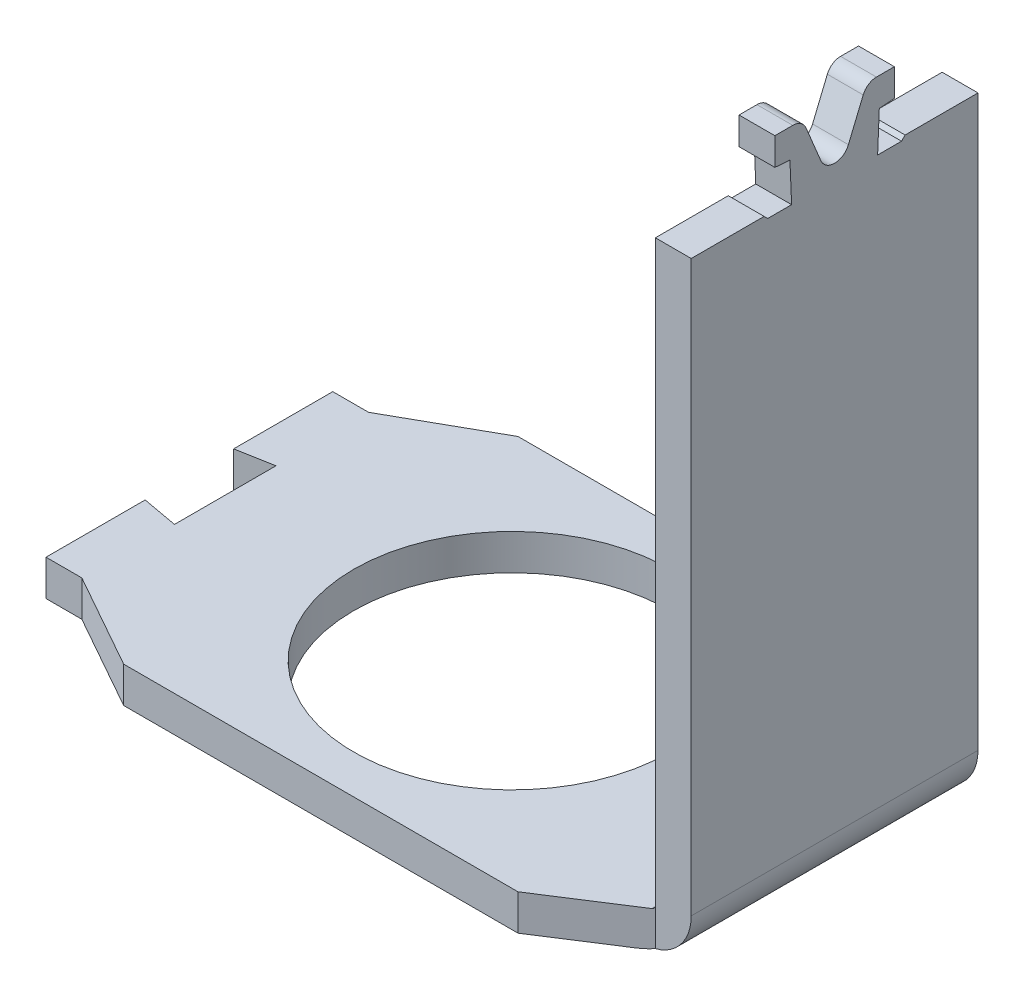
ISO-10303-21;
HEADER;
FILE_DESCRIPTION(('STEP AP214'),'2;1');
FILE_NAME('part.step','',(''),(''),'','','');
FILE_SCHEMA(('AUTOMOTIVE_DESIGN { 1 0 10303 214 1 1 1 1 }'));
ENDSEC;
DATA;
#1=APPLICATION_CONTEXT('core data for automotive mechanical design processes');
#2=APPLICATION_PROTOCOL_DEFINITION('international standard','automotive_design',2000,#1);
#3=PRODUCT_CONTEXT('',#1,'mechanical');
#4=PRODUCT('Part','Part','',(#3));
#5=PRODUCT_RELATED_PRODUCT_CATEGORY('part','',(#4));
#6=PRODUCT_DEFINITION_FORMATION('','',#4);
#7=PRODUCT_DEFINITION_CONTEXT('part definition',#1,'design');
#8=PRODUCT_DEFINITION('design','',#6,#7);
#9=PRODUCT_DEFINITION_SHAPE('','',#8);
#10=(LENGTH_UNIT() NAMED_UNIT(*) SI_UNIT(.MILLI.,.METRE.));
#11=(NAMED_UNIT(*) PLANE_ANGLE_UNIT() SI_UNIT($,.RADIAN.));
#12=(NAMED_UNIT(*) SI_UNIT($,.STERADIAN.) SOLID_ANGLE_UNIT());
#13=UNCERTAINTY_MEASURE_WITH_UNIT(LENGTH_MEASURE(1.E-05),#10,'distance_accuracy_value','');
#14=(GEOMETRIC_REPRESENTATION_CONTEXT(3) GLOBAL_UNCERTAINTY_ASSIGNED_CONTEXT((#13)) GLOBAL_UNIT_ASSIGNED_CONTEXT((#10,
#11,#12)) REPRESENTATION_CONTEXT('',''));
#15=CARTESIAN_POINT('',(0.,0.,0.));
#16=DIRECTION('',(0.,0.,1.));
#17=DIRECTION('',(1.,0.,0.));
#18=AXIS2_PLACEMENT_3D('',#15,#16,#17);
#19=CARTESIAN_POINT('',(0.,57.05,16.5));
#20=DIRECTION('',(0.,-1.,0.));
#21=DIRECTION('',(0.,0.,-1.));
#22=AXIS2_PLACEMENT_3D('',#19,#20,#21);
#23=PLANE('',#22);
#24=DIRECTION('',(-1.,0.,0.));
#25=VECTOR('',#24,1.);
#26=CARTESIAN_POINT('',(0.,57.05,3.5));
#27=LINE('',#26,#25);
#28=CARTESIAN_POINT('',(0.,57.05,3.5));
#29=VERTEX_POINT('',#28);
#30=CARTESIAN_POINT('',(-3.,57.05,3.5));
#31=VERTEX_POINT('',#30);
#32=EDGE_CURVE('E357',#29,#31,#27,.T.);
#33=ORIENTED_EDGE('',*,*,#32,.T.);
#34=DIRECTION('',(0.,0.,-1.));
#35=VECTOR('',#34,1.);
#36=CARTESIAN_POINT('',(-3.,57.05,16.5));
#37=LINE('',#36,#35);
#38=CARTESIAN_POINT('',(-3.,57.05,5.));
#39=VERTEX_POINT('',#38);
#40=EDGE_CURVE('E534',#39,#31,#37,.T.);
#41=ORIENTED_EDGE('',*,*,#40,.F.);
#42=DIRECTION('',(-1.,0.,0.));
#43=VECTOR('',#42,1.);
#44=CARTESIAN_POINT('',(0.,57.05,5.));
#45=LINE('',#44,#43);
#46=CARTESIAN_POINT('',(0.,57.05,5.));
#47=VERTEX_POINT('',#46);
#48=EDGE_CURVE('E412',#47,#39,#45,.T.);
#49=ORIENTED_EDGE('',*,*,#48,.F.);
#50=DIRECTION('',(0.,0.,-1.));
#51=VECTOR('',#50,1.);
#52=CARTESIAN_POINT('',(0.,57.05,16.5));
#53=LINE('',#52,#51);
#54=EDGE_CURVE('E538',#47,#29,#53,.T.);
#55=ORIENTED_EDGE('',*,*,#54,.T.);
#56=EDGE_LOOP('',(#33,#41,#49,#55));
#57=FACE_BOUND('',#56,.T.);
#58=ADVANCED_FACE('F32',(#57),#23,.F.);
#59=CARTESIAN_POINT('',(-54.,0.,16.5));
#60=DIRECTION('',(1.,0.,0.));
#61=DIRECTION('',(0.,0.,-1.));
#62=AXIS2_PLACEMENT_3D('',#59,#60,#61);
#63=PLANE('',#62);
#64=DIRECTION('',(0.,0.,-1.));
#65=VECTOR('',#64,1.);
#66=CARTESIAN_POINT('',(-54.,2.99999999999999,16.5));
#67=LINE('',#66,#65);
#68=CARTESIAN_POINT('',(-54.,3.,-3.7));
#69=VERTEX_POINT('',#68);
#70=CARTESIAN_POINT('',(-54.,2.99999999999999,-12.));
#71=VERTEX_POINT('',#70);
#72=EDGE_CURVE('E523',#69,#71,#67,.T.);
#73=ORIENTED_EDGE('',*,*,#72,.T.);
#74=DIRECTION('',(0.,-1.,0.));
#75=VECTOR('',#74,1.);
#76=CARTESIAN_POINT('',(-54.,0.,-12.));
#77=LINE('',#76,#75);
#78=CARTESIAN_POINT('',(-54.,0.,-12.));
#79=VERTEX_POINT('',#78);
#80=EDGE_CURVE('E572',#71,#79,#77,.T.);
#81=ORIENTED_EDGE('',*,*,#80,.T.);
#82=DIRECTION('',(0.,0.,-1.));
#83=VECTOR('',#82,1.);
#84=CARTESIAN_POINT('',(-54.,0.,16.5));
#85=LINE('',#84,#83);
#86=CARTESIAN_POINT('',(-54.,0.,-3.7));
#87=VERTEX_POINT('',#86);
#88=EDGE_CURVE('E547',#87,#79,#85,.T.);
#89=ORIENTED_EDGE('',*,*,#88,.F.);
#90=DIRECTION('',(0.,1.,0.));
#91=VECTOR('',#90,1.);
#92=CARTESIAN_POINT('',(-54.,0.,-3.7));
#93=LINE('',#92,#91);
#94=EDGE_CURVE('E569',#87,#69,#93,.T.);
#95=ORIENTED_EDGE('',*,*,#94,.T.);
#96=EDGE_LOOP('',(#73,#81,#89,#95));
#97=FACE_BOUND('',#96,.T.);
#98=ADVANCED_FACE('F669',(#97),#63,.F.);
#99=CARTESIAN_POINT('',(-4.00000000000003,0.,16.5));
#100=DIRECTION('',(0.,1.,0.));
#101=DIRECTION('',(-1.,0.,0.));
#102=AXIS2_PLACEMENT_3D('',#99,#100,#101);
#103=PLANE('',#102);
#104=DIRECTION('',(0.,0.,-1.));
#105=VECTOR('',#104,1.);
#106=CARTESIAN_POINT('',(-4.00000000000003,0.,16.5));
#107=LINE('',#106,#105);
#108=CARTESIAN_POINT('',(-4.00000000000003,0.,12.6428571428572));
#109=VERTEX_POINT('',#108);
#110=CARTESIAN_POINT('',(-4.00000000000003,0.,-12.6428571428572));
#111=VERTEX_POINT('',#110);
#112=EDGE_CURVE('E544',#109,#111,#107,.T.);
#113=ORIENTED_EDGE('',*,*,#112,.F.);
#114=DIRECTION('',(-0.841178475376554,0.,0.540757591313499));
#115=VECTOR('',#114,1.);
#116=CARTESIAN_POINT('',(-5.75451263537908,0.,13.7707581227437));
#117=LINE('',#116,#115);
#118=CARTESIAN_POINT('',(-9.99999999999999,0.,16.5));
#119=VERTEX_POINT('',#118);
#120=EDGE_CURVE('E471',#109,#119,#117,.T.);
#121=ORIENTED_EDGE('',*,*,#120,.T.);
#122=DIRECTION('',(1.,0.,0.));
#123=VECTOR('',#122,1.);
#124=CARTESIAN_POINT('',(-4.00000000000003,0.,16.5));
#125=LINE('',#124,#123);
#126=CARTESIAN_POINT('',(-43.,0.,16.5));
#127=VERTEX_POINT('',#126);
#128=EDGE_CURVE('E517',#127,#119,#125,.T.);
#129=ORIENTED_EDGE('',*,*,#128,.F.);
#130=DIRECTION('',(-0.871575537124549,0.,-0.490261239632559));
#131=VECTOR('',#130,1.);
#132=CARTESIAN_POINT('',(-13.3738872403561,0.,33.1646884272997));
#133=LINE('',#132,#131);
#134=CARTESIAN_POINT('',(-51.,0.,12.));
#135=VERTEX_POINT('',#134);
#136=EDGE_CURVE('E459',#127,#135,#133,.T.);
#137=ORIENTED_EDGE('',*,*,#136,.T.);
#138=DIRECTION('',(-1.,0.,0.));
#139=VECTOR('',#138,1.);
#140=CARTESIAN_POINT('',(-4.00000000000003,0.,12.));
#141=LINE('',#140,#139);
#142=CARTESIAN_POINT('',(-54.,0.,12.));
#143=VERTEX_POINT('',#142);
#144=EDGE_CURVE('E483',#135,#143,#141,.T.);
#145=ORIENTED_EDGE('',*,*,#144,.T.);
#146=CARTESIAN_POINT('',(-54.,0.,3.7));
#147=VERTEX_POINT('',#146);
#148=EDGE_CURVE('E550',#143,#147,#85,.T.);
#149=ORIENTED_EDGE('',*,*,#148,.T.);
#150=DIRECTION('',(0.983606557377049,0.,0.180327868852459));
#151=VECTOR('',#150,1.);
#152=CARTESIAN_POINT('',(-3.35554958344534,0.,12.9848159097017));
#153=LINE('',#152,#151);
#154=CARTESIAN_POINT('',(-51.,0.,4.25));
#155=VERTEX_POINT('',#154);
#156=EDGE_CURVE('E489',#147,#155,#153,.T.);
#157=ORIENTED_EDGE('',*,*,#156,.T.);
#158=DIRECTION('',(0.,0.,-1.));
#159=VECTOR('',#158,1.);
#160=CARTESIAN_POINT('',(-51.,0.,16.5));
#161=LINE('',#160,#159);
#162=CARTESIAN_POINT('',(-51.,0.,-4.25));
#163=VERTEX_POINT('',#162);
#164=EDGE_CURVE('E504',#155,#163,#161,.T.);
#165=ORIENTED_EDGE('',*,*,#164,.T.);
#166=DIRECTION('',(-0.983606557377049,0.,0.180327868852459));
#167=VECTOR('',#166,1.);
#168=CARTESIAN_POINT('',(-9.20881483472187,0.,-11.911717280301));
#169=LINE('',#168,#167);
#170=EDGE_CURVE('E495',#163,#87,#169,.T.);
#171=ORIENTED_EDGE('',*,*,#170,.T.);
#172=ORIENTED_EDGE('',*,*,#88,.T.);
#173=DIRECTION('',(1.,0.,0.));
#174=VECTOR('',#173,1.);
#175=CARTESIAN_POINT('',(-4.00000000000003,0.,-12.));
#176=LINE('',#175,#174);
#177=CARTESIAN_POINT('',(-51.,0.,-12.));
#178=VERTEX_POINT('',#177);
#179=EDGE_CURVE('E501',#79,#178,#176,.T.);
#180=ORIENTED_EDGE('',*,*,#179,.T.);
#181=DIRECTION('',(0.871575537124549,0.,-0.490261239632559));
#182=VECTOR('',#181,1.);
#183=CARTESIAN_POINT('',(-27.4747774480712,0.,-25.2329376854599));
#184=LINE('',#183,#182);
#185=CARTESIAN_POINT('',(-43.,0.,-16.5));
#186=VERTEX_POINT('',#185);
#187=EDGE_CURVE('E441',#178,#186,#184,.T.);
#188=ORIENTED_EDGE('',*,*,#187,.T.);
#189=DIRECTION('',(1.,0.,0.));
#190=VECTOR('',#189,1.);
#191=CARTESIAN_POINT('',(-4.00000000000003,0.,-16.5));
#192=LINE('',#191,#190);
#193=CARTESIAN_POINT('',(-10.,0.,-16.5));
#194=VERTEX_POINT('',#193);
#195=EDGE_CURVE('E511',#186,#194,#192,.T.);
#196=ORIENTED_EDGE('',*,*,#195,.T.);
#197=DIRECTION('',(0.841178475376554,0.,0.540757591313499));
#198=VECTOR('',#197,1.);
#199=CARTESIAN_POINT('',(9.25631768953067,0.,-4.12093862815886));
#200=LINE('',#199,#198);
#201=EDGE_CURVE('E453',#194,#111,#200,.T.);
#202=ORIENTED_EDGE('',*,*,#201,.T.);
#203=EDGE_LOOP('',(#113,#121,#129,#137,#145,#149,#157,#165,#171,#172,#180,#188,#196,#202));
#204=FACE_BOUND('',#203,.T.);
#205=CARTESIAN_POINT('',(-27.,0.,0.));
#206=DIRECTION('',(0.,1.,0.));
#207=DIRECTION('',(-1.,0.,0.));
#208=AXIS2_PLACEMENT_3D('',#205,#206,#207);
#209=CIRCLE('',#208,13.25);
#210=CARTESIAN_POINT('',(-40.25,0.,0.));
#211=VERTEX_POINT('',#210);
#212=EDGE_CURVE('E508',#211,#211,#209,.F.);
#213=ORIENTED_EDGE('',*,*,#212,.F.);
#214=EDGE_LOOP('',(#213));
#215=FACE_BOUND('',#214,.T.);
#216=ADVANCED_FACE('F612',(#204,#215),#103,.F.);
#217=CARTESIAN_POINT('',(-3.2,3.,16.5));
#218=DIRECTION('',(0.,-1.,0.));
#219=DIRECTION('',(1.,0.,0.));
#220=AXIS2_PLACEMENT_3D('',#217,#218,#219);
#221=PLANE('',#220);
#222=DIRECTION('',(-1.,0.,0.));
#223=VECTOR('',#222,1.);
#224=CARTESIAN_POINT('',(-3.2,3.,16.5));
#225=LINE('',#224,#223);
#226=CARTESIAN_POINT('',(-10.,3.,16.5));
#227=VERTEX_POINT('',#226);
#228=CARTESIAN_POINT('',(-43.,3.,16.5));
#229=VERTEX_POINT('',#228);
#230=EDGE_CURVE('E520',#227,#229,#225,.T.);
#231=ORIENTED_EDGE('',*,*,#230,.F.);
#232=DIRECTION('',(0.841178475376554,0.,-0.540757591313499));
#233=VECTOR('',#232,1.);
#234=CARTESIAN_POINT('',(-5.1884476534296,3.,13.4068592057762));
#235=LINE('',#234,#233);
#236=CARTESIAN_POINT('',(-3.2,3.,12.1285714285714));
#237=VERTEX_POINT('',#236);
#238=EDGE_CURVE('E465',#227,#237,#235,.T.);
#239=ORIENTED_EDGE('',*,*,#238,.T.);
#240=DIRECTION('',(0.,0.,-1.));
#241=VECTOR('',#240,1.);
#242=CARTESIAN_POINT('',(-3.2,3.,16.5));
#243=LINE('',#242,#241);
#244=CARTESIAN_POINT('',(-3.2,3.,-12.1285714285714));
#245=VERTEX_POINT('',#244);
#246=EDGE_CURVE('E527',#237,#245,#243,.T.);
#247=ORIENTED_EDGE('',*,*,#246,.T.);
#248=DIRECTION('',(-0.841178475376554,0.,-0.540757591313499));
#249=VECTOR('',#248,1.);
#250=CARTESIAN_POINT('',(9.82238267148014,3.,-3.75703971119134));
#251=LINE('',#250,#249);
#252=CARTESIAN_POINT('',(-9.99999999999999,3.,-16.5));
#253=VERTEX_POINT('',#252);
#254=EDGE_CURVE('E447',#245,#253,#251,.T.);
#255=ORIENTED_EDGE('',*,*,#254,.T.);
#256=DIRECTION('',(-1.,0.,0.));
#257=VECTOR('',#256,1.);
#258=CARTESIAN_POINT('',(-3.2,3.,-16.5));
#259=LINE('',#258,#257);
#260=CARTESIAN_POINT('',(-43.,3.,-16.5));
#261=VERTEX_POINT('',#260);
#262=EDGE_CURVE('E514',#253,#261,#259,.T.);
#263=ORIENTED_EDGE('',*,*,#262,.T.);
#264=DIRECTION('',(-0.871575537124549,0.,0.490261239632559));
#265=VECTOR('',#264,1.);
#266=CARTESIAN_POINT('',(-26.8670623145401,3.,-25.5747774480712));
#267=LINE('',#266,#265);
#268=CARTESIAN_POINT('',(-51.,3.,-12.));
#269=VERTEX_POINT('',#268);
#270=EDGE_CURVE('E438',#261,#269,#267,.T.);
#271=ORIENTED_EDGE('',*,*,#270,.T.);
#272=DIRECTION('',(-1.,0.,0.));
#273=VECTOR('',#272,1.);
#274=CARTESIAN_POINT('',(-3.2,3.,-12.));
#275=LINE('',#274,#273);
#276=EDGE_CURVE('E498',#269,#71,#275,.T.);
#277=ORIENTED_EDGE('',*,*,#276,.T.);
#278=ORIENTED_EDGE('',*,*,#72,.F.);
#279=DIRECTION('',(0.983606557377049,0.,-0.180327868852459));
#280=VECTOR('',#279,1.);
#281=CARTESIAN_POINT('',(-8.43482934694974,3.,-12.0536146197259));
#282=LINE('',#281,#280);
#283=CARTESIAN_POINT('',(-51.,3.,-4.25));
#284=VERTEX_POINT('',#283);
#285=EDGE_CURVE('E492',#69,#284,#282,.T.);
#286=ORIENTED_EDGE('',*,*,#285,.T.);
#287=DIRECTION('',(0.,0.,1.));
#288=VECTOR('',#287,1.);
#289=CARTESIAN_POINT('',(-51.,2.99999999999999,16.5));
#290=LINE('',#289,#288);
#291=CARTESIAN_POINT('',(-51.,3.,4.25));
#292=VERTEX_POINT('',#291);
#293=EDGE_CURVE('E575',#284,#292,#290,.T.);
#294=ORIENTED_EDGE('',*,*,#293,.T.);
#295=DIRECTION('',(-0.983606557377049,0.,-0.180327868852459));
#296=VECTOR('',#295,1.);
#297=CARTESIAN_POINT('',(-2.58156409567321,3.,13.1267132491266));
#298=LINE('',#297,#296);
#299=CARTESIAN_POINT('',(-54.,3.,3.7));
#300=VERTEX_POINT('',#299);
#301=EDGE_CURVE('E486',#292,#300,#298,.T.);
#302=ORIENTED_EDGE('',*,*,#301,.T.);
#303=CARTESIAN_POINT('',(-54.,2.99999999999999,12.));
#304=VERTEX_POINT('',#303);
#305=EDGE_CURVE('E526',#304,#300,#67,.T.);
#306=ORIENTED_EDGE('',*,*,#305,.F.);
#307=DIRECTION('',(1.,0.,0.));
#308=VECTOR('',#307,1.);
#309=CARTESIAN_POINT('',(-3.2,3.,12.));
#310=LINE('',#309,#308);
#311=CARTESIAN_POINT('',(-51.,3.,12.));
#312=VERTEX_POINT('',#311);
#313=EDGE_CURVE('E480',#304,#312,#310,.T.);
#314=ORIENTED_EDGE('',*,*,#313,.T.);
#315=DIRECTION('',(0.871575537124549,0.,0.490261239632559));
#316=VECTOR('',#315,1.);
#317=CARTESIAN_POINT('',(-12.7661721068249,3.,33.506528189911));
#318=LINE('',#317,#316);
#319=EDGE_CURVE('E456',#312,#229,#318,.T.);
#320=ORIENTED_EDGE('',*,*,#319,.T.);
#321=EDGE_LOOP('',(#231,#239,#247,#255,#263,#271,#277,#278,#286,#294,#302,#306,#314,#320));
#322=FACE_BOUND('',#321,.T.);
#323=CARTESIAN_POINT('',(-27.,3.,0.));
#324=DIRECTION('',(0.,-1.,0.));
#325=DIRECTION('',(1.,0.,0.));
#326=AXIS2_PLACEMENT_3D('',#323,#324,#325);
#327=CIRCLE('',#326,13.25);
#328=CARTESIAN_POINT('',(-13.75,3.,0.));
#329=VERTEX_POINT('',#328);
#330=EDGE_CURVE('E507',#329,#329,#327,.F.);
#331=ORIENTED_EDGE('',*,*,#330,.F.);
#332=EDGE_LOOP('',(#331));
#333=FACE_BOUND('',#332,.T.);
#334=ADVANCED_FACE('F604',(#322,#333),#221,.F.);
#335=ORIENTED_EDGE('',*,*,#305,.T.);
#336=DIRECTION('',(0.,-1.,0.));
#337=VECTOR('',#336,1.);
#338=CARTESIAN_POINT('',(-54.,0.,3.7));
#339=LINE('',#338,#337);
#340=EDGE_CURVE('E566',#300,#147,#339,.T.);
#341=ORIENTED_EDGE('',*,*,#340,.T.);
#342=ORIENTED_EDGE('',*,*,#148,.F.);
#343=DIRECTION('',(0.,1.,0.));
#344=VECTOR('',#343,1.);
#345=CARTESIAN_POINT('',(-54.,0.,12.));
#346=LINE('',#345,#344);
#347=EDGE_CURVE('E563',#143,#304,#346,.T.);
#348=ORIENTED_EDGE('',*,*,#347,.T.);
#349=EDGE_LOOP('',(#335,#341,#342,#348));
#350=FACE_BOUND('',#349,.T.);
#351=ADVANCED_FACE('F34',(#350),#63,.F.);
#352=CARTESIAN_POINT('',(-4.,4.,16.5));
#353=DIRECTION('',(0.,0.,-1.));
#354=DIRECTION('',(-1.,0.,0.));
#355=AXIS2_PLACEMENT_3D('',#352,#353,#354);
#356=CYLINDRICAL_SURFACE('',#355,4.);
#357=CARTESIAN_POINT('',(-4.,4.,12.));
#358=DIRECTION('',(0.,0.,-1.));
#359=DIRECTION('',(-1.,0.,0.));
#360=AXIS2_PLACEMENT_3D('',#357,#358,#359);
#361=CIRCLE('',#360,4.);
#362=CARTESIAN_POINT('',(0.,4.00000000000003,12.));
#363=VERTEX_POINT('',#362);
#364=CARTESIAN_POINT('',(-2.99999999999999,0.127016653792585,12.));
#365=VERTEX_POINT('',#364);
#366=EDGE_CURVE('E477',#363,#365,#361,.T.);
#367=ORIENTED_EDGE('',*,*,#366,.T.);
#368=CARTESIAN_POINT('',(-4.,4.,12.6428571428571));
#369=DIRECTION('',(-0.540757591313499,0.,-0.841178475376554));
#370=DIRECTION('',(0.841178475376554,0.,-0.540757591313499));
#371=AXIS2_PLACEMENT_3D('',#368,#369,#370);
#372=ELLIPSE('',#371,4.75523342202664,4.);
#373=EDGE_CURVE('E468',#365,#109,#372,.T.);
#374=ORIENTED_EDGE('',*,*,#373,.T.);
#375=ORIENTED_EDGE('',*,*,#112,.T.);
#376=CARTESIAN_POINT('',(-4.,4.,-12.6428571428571));
#377=DIRECTION('',(-0.540757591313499,0.,0.841178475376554));
#378=DIRECTION('',(-0.841178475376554,0.,-0.540757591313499));
#379=AXIS2_PLACEMENT_3D('',#376,#377,#378);
#380=ELLIPSE('',#379,4.75523342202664,4.);
#381=CARTESIAN_POINT('',(-2.99999999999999,0.127016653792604,-12.));
#382=VERTEX_POINT('',#381);
#383=EDGE_CURVE('E450',#111,#382,#380,.T.);
#384=ORIENTED_EDGE('',*,*,#383,.T.);
#385=CARTESIAN_POINT('',(-4.,4.,-12.));
#386=DIRECTION('',(0.,0.,1.));
#387=DIRECTION('',(1.,0.,0.));
#388=AXIS2_PLACEMENT_3D('',#385,#386,#387);
#389=CIRCLE('',#388,4.);
#390=CARTESIAN_POINT('',(0.,4.00000000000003,-12.));
#391=VERTEX_POINT('',#390);
#392=EDGE_CURVE('E474',#382,#391,#389,.T.);
#393=ORIENTED_EDGE('',*,*,#392,.T.);
#394=DIRECTION('',(0.,0.,-1.));
#395=VECTOR('',#394,1.);
#396=CARTESIAN_POINT('',(0.,4.00000000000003,16.5));
#397=LINE('',#396,#395);
#398=EDGE_CURVE('E541',#363,#391,#397,.T.);
#399=ORIENTED_EDGE('',*,*,#398,.F.);
#400=EDGE_LOOP('',(#367,#374,#375,#384,#393,#399));
#401=FACE_BOUND('',#400,.T.);
#402=ADVANCED_FACE('F615',(#401),#356,.T.);
#403=CARTESIAN_POINT('',(0.,4.00000000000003,16.5));
#404=DIRECTION('',(-1.,0.,0.));
#405=DIRECTION('',(0.,0.,1.));
#406=AXIS2_PLACEMENT_3D('',#403,#404,#405);
#407=PLANE('',#406);
#408=DIRECTION('',(0.,-1.,0.));
#409=VECTOR('',#408,1.);
#410=CARTESIAN_POINT('',(0.,57.05,-12.));
#411=LINE('',#410,#409);
#412=CARTESIAN_POINT('',(0.,51.65,-12.));
#413=VERTEX_POINT('',#412);
#414=EDGE_CURVE('E431',#413,#391,#411,.T.);
#415=ORIENTED_EDGE('',*,*,#414,.F.);
#416=DIRECTION('',(0.,0.,1.));
#417=VECTOR('',#416,1.);
#418=CARTESIAN_POINT('',(0.,51.65,-5.90000000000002));
#419=LINE('',#418,#417);
#420=CARTESIAN_POINT('',(0.,51.65,-5.90000000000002));
#421=VERTEX_POINT('',#420);
#422=EDGE_CURVE('E47',#413,#421,#419,.T.);
#423=ORIENTED_EDGE('',*,*,#422,.T.);
#424=DIRECTION('',(0.,-0.707106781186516,0.707106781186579));
#425=VECTOR('',#424,1.);
#426=CARTESIAN_POINT('',(0.,51.35,-5.6));
#427=LINE('',#426,#425);
#428=CARTESIAN_POINT('',(0.,51.35,-5.6));
#429=VERTEX_POINT('',#428);
#430=EDGE_CURVE('E303',#421,#429,#427,.T.);
#431=ORIENTED_EDGE('',*,*,#430,.T.);
#432=DIRECTION('',(0.,0.,1.));
#433=VECTOR('',#432,1.);
#434=CARTESIAN_POINT('',(0.,51.35,-3.6));
#435=LINE('',#434,#433);
#436=CARTESIAN_POINT('',(0.,51.35,-3.6));
#437=VERTEX_POINT('',#436);
#438=EDGE_CURVE('E306',#429,#437,#435,.T.);
#439=ORIENTED_EDGE('',*,*,#438,.T.);
#440=DIRECTION('',(0.,0.999122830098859,-0.0418756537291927));
#441=VECTOR('',#440,1.);
#442=CARTESIAN_POINT('',(0.,51.35,-3.6));
#443=LINE('',#442,#441);
#444=CARTESIAN_POINT('',(0.,54.65,-3.73831097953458));
#445=VERTEX_POINT('',#444);
#446=EDGE_CURVE('E282',#437,#445,#443,.T.);
#447=ORIENTED_EDGE('',*,*,#446,.T.);
#448=DIRECTION('',(0.,0.07901104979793,-0.996873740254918));
#449=VECTOR('',#448,1.);
#450=CARTESIAN_POINT('',(0.,54.65,-3.73831097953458));
#451=LINE('',#450,#449);
#452=CARTESIAN_POINT('',(0.,54.75,-5.));
#453=VERTEX_POINT('',#452);
#454=EDGE_CURVE('E275',#445,#453,#451,.T.);
#455=ORIENTED_EDGE('',*,*,#454,.T.);
#456=DIRECTION('',(0.,1.,0.));
#457=VECTOR('',#456,1.);
#458=CARTESIAN_POINT('',(0.,54.75,-5.));
#459=LINE('',#458,#457);
#460=CARTESIAN_POINT('',(0.,57.05,-5.));
#461=VERTEX_POINT('',#460);
#462=EDGE_CURVE('E285',#453,#461,#459,.T.);
#463=ORIENTED_EDGE('',*,*,#462,.T.);
#464=CARTESIAN_POINT('',(0.,57.05,-3.5));
#465=VERTEX_POINT('',#464);
#466=EDGE_CURVE('E537',#465,#461,#53,.T.);
#467=ORIENTED_EDGE('',*,*,#466,.F.);
#468=CARTESIAN_POINT('',(0.,55.85,-3.5));
#469=DIRECTION('',(1.,0.,0.));
#470=DIRECTION('',(0.,1.,0.));
#471=AXIS2_PLACEMENT_3D('',#468,#469,#470);
#472=CIRCLE('',#471,1.2);
#473=CARTESIAN_POINT('',(0.,56.3089036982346,-2.39121354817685));
#474=VERTEX_POINT('',#473);
#475=EDGE_CURVE('E330',#465,#474,#472,.T.);
#476=ORIENTED_EDGE('',*,*,#475,.T.);
#477=DIRECTION('',(0.,-0.923988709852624,0.38241974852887));
#478=VECTOR('',#477,1.);
#479=CARTESIAN_POINT('',(0.,53.3219753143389,-1.15498588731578));
#480=LINE('',#479,#478);
#481=CARTESIAN_POINT('',(0.,53.3219753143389,-1.15498588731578));
#482=VERTEX_POINT('',#481);
#483=EDGE_CURVE('E333',#474,#482,#480,.T.);
#484=ORIENTED_EDGE('',*,*,#483,.T.);
#485=CARTESIAN_POINT('',(0.,53.8,0.));
#486=DIRECTION('',(-1.,0.,0.));
#487=DIRECTION('',(0.,-1.,0.));
#488=AXIS2_PLACEMENT_3D('',#485,#486,#487);
#489=CIRCLE('',#488,1.25000000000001);
#490=CARTESIAN_POINT('',(0.,53.3219753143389,1.15498588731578));
#491=VERTEX_POINT('',#490);
#492=EDGE_CURVE('E337',#482,#491,#489,.T.);
#493=ORIENTED_EDGE('',*,*,#492,.T.);
#494=DIRECTION('',(0.,0.923988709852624,0.38241974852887));
#495=VECTOR('',#494,1.);
#496=CARTESIAN_POINT('',(0.,53.3219753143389,1.15498588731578));
#497=LINE('',#496,#495);
#498=CARTESIAN_POINT('',(0.,56.3089036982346,2.39121354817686));
#499=VERTEX_POINT('',#498);
#500=EDGE_CURVE('E340',#491,#499,#497,.T.);
#501=ORIENTED_EDGE('',*,*,#500,.T.);
#502=CARTESIAN_POINT('',(0.,55.85,3.5));
#503=DIRECTION('',(1.,0.,0.));
#504=DIRECTION('',(0.,-1.,0.));
#505=AXIS2_PLACEMENT_3D('',#502,#503,#504);
#506=CIRCLE('',#505,1.2);
#507=EDGE_CURVE('E343',#499,#29,#506,.T.);
#508=ORIENTED_EDGE('',*,*,#507,.T.);
#509=ORIENTED_EDGE('',*,*,#54,.F.);
#510=DIRECTION('',(0.,-1.,0.));
#511=VECTOR('',#510,1.);
#512=CARTESIAN_POINT('',(0.,54.75,5.));
#513=LINE('',#512,#511);
#514=CARTESIAN_POINT('',(0.,54.75,5.));
#515=VERTEX_POINT('',#514);
#516=EDGE_CURVE('E380',#47,#515,#513,.T.);
#517=ORIENTED_EDGE('',*,*,#516,.T.);
#518=DIRECTION('',(0.,-0.07901104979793,-0.996873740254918));
#519=VECTOR('',#518,1.);
#520=CARTESIAN_POINT('',(0.,54.65,3.73831097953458));
#521=LINE('',#520,#519);
#522=CARTESIAN_POINT('',(0.,54.65,3.73831097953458));
#523=VERTEX_POINT('',#522);
#524=EDGE_CURVE('E383',#515,#523,#521,.T.);
#525=ORIENTED_EDGE('',*,*,#524,.T.);
#526=DIRECTION('',(0.,-0.999122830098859,-0.0418756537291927));
#527=VECTOR('',#526,1.);
#528=CARTESIAN_POINT('',(0.,51.35,3.6));
#529=LINE('',#528,#527);
#530=CARTESIAN_POINT('',(0.,51.35,3.6));
#531=VERTEX_POINT('',#530);
#532=EDGE_CURVE('E386',#523,#531,#529,.T.);
#533=ORIENTED_EDGE('',*,*,#532,.T.);
#534=DIRECTION('',(0.,0.,1.));
#535=VECTOR('',#534,1.);
#536=CARTESIAN_POINT('',(0.,51.35,3.6));
#537=LINE('',#536,#535);
#538=CARTESIAN_POINT('',(0.,51.35,5.6));
#539=VERTEX_POINT('',#538);
#540=EDGE_CURVE('E370',#531,#539,#537,.T.);
#541=ORIENTED_EDGE('',*,*,#540,.T.);
#542=DIRECTION('',(0.,0.707106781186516,0.707106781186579));
#543=VECTOR('',#542,1.);
#544=CARTESIAN_POINT('',(0.,51.35,5.6));
#545=LINE('',#544,#543);
#546=CARTESIAN_POINT('',(0.,51.65,5.90000000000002));
#547=VERTEX_POINT('',#546);
#548=EDGE_CURVE('E373',#539,#547,#545,.T.);
#549=ORIENTED_EDGE('',*,*,#548,.T.);
#550=DIRECTION('',(0.,0.,1.));
#551=VECTOR('',#550,1.);
#552=CARTESIAN_POINT('',(0.,51.65,5.90000000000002));
#553=LINE('',#552,#551);
#554=CARTESIAN_POINT('',(0.,51.65,12.));
#555=VERTEX_POINT('',#554);
#556=EDGE_CURVE('E377',#547,#555,#553,.T.);
#557=ORIENTED_EDGE('',*,*,#556,.T.);
#558=DIRECTION('',(0.,-1.,0.));
#559=VECTOR('',#558,1.);
#560=CARTESIAN_POINT('',(0.,57.05,12.));
#561=LINE('',#560,#559);
#562=EDGE_CURVE('E433',#555,#363,#561,.T.);
#563=ORIENTED_EDGE('',*,*,#562,.T.);
#564=ORIENTED_EDGE('',*,*,#398,.T.);
#565=EDGE_LOOP('',(#415,#423,#431,#439,#447,#455,#463,#467,#476,#484,#493,#501,#508,#509,#517,
#525,#533,#541,#549,#557,#563,#564));
#566=FACE_BOUND('',#565,.T.);
#567=ADVANCED_FACE('F293',(#566),#407,.F.);
#568=ORIENTED_EDGE('',*,*,#466,.T.);
#569=DIRECTION('',(-1.,0.,0.));
#570=VECTOR('',#569,1.);
#571=CARTESIAN_POINT('',(0.,57.05,-5.));
#572=LINE('',#571,#570);
#573=CARTESIAN_POINT('',(-3.,57.05,-5.));
#574=VERTEX_POINT('',#573);
#575=EDGE_CURVE('E281',#461,#574,#572,.T.);
#576=ORIENTED_EDGE('',*,*,#575,.T.);
#577=CARTESIAN_POINT('',(-3.,57.05,-3.5));
#578=VERTEX_POINT('',#577);
#579=EDGE_CURVE('E533',#578,#574,#37,.T.);
#580=ORIENTED_EDGE('',*,*,#579,.F.);
#581=DIRECTION('',(-1.,0.,0.));
#582=VECTOR('',#581,1.);
#583=CARTESIAN_POINT('',(0.,57.05,-3.5));
#584=LINE('',#583,#582);
#585=EDGE_CURVE('E54',#465,#578,#584,.T.);
#586=ORIENTED_EDGE('',*,*,#585,.F.);
#587=EDGE_LOOP('',(#568,#576,#580,#586));
#588=FACE_BOUND('',#587,.T.);
#589=ADVANCED_FACE('F659',(#588),#23,.F.);
#590=CARTESIAN_POINT('',(-3.,3.2,16.5));
#591=DIRECTION('',(1.,0.,0.));
#592=DIRECTION('',(0.,1.,0.));
#593=AXIS2_PLACEMENT_3D('',#590,#591,#592);
#594=PLANE('',#593);
#595=DIRECTION('',(0.,-0.707106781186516,0.707106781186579));
#596=VECTOR('',#595,1.);
#597=CARTESIAN_POINT('',(-3.,51.35,-5.6));
#598=LINE('',#597,#596);
#599=CARTESIAN_POINT('',(-3.,51.65,-5.90000000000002));
#600=VERTEX_POINT('',#599);
#601=CARTESIAN_POINT('',(-3.,51.35,-5.6));
#602=VERTEX_POINT('',#601);
#603=EDGE_CURVE('E314',#600,#602,#598,.T.);
#604=ORIENTED_EDGE('',*,*,#603,.F.);
#605=DIRECTION('',(0.,0.,1.));
#606=VECTOR('',#605,1.);
#607=CARTESIAN_POINT('',(-3.,51.65,-5.90000000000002));
#608=LINE('',#607,#606);
#609=CARTESIAN_POINT('',(-3.,51.65,-12.));
#610=VERTEX_POINT('',#609);
#611=EDGE_CURVE('E312',#610,#600,#608,.T.);
#612=ORIENTED_EDGE('',*,*,#611,.F.);
#613=DIRECTION('',(0.,-1.,0.));
#614=VECTOR('',#613,1.);
#615=CARTESIAN_POINT('',(-3.,57.05,-12.));
#616=LINE('',#615,#614);
#617=CARTESIAN_POINT('',(-3.,3.2,-12.));
#618=VERTEX_POINT('',#617);
#619=EDGE_CURVE('E429',#610,#618,#616,.T.);
#620=ORIENTED_EDGE('',*,*,#619,.T.);
#621=DIRECTION('',(0.,0.,-1.));
#622=VECTOR('',#621,1.);
#623=CARTESIAN_POINT('',(-3.,3.2,16.5));
#624=LINE('',#623,#622);
#625=CARTESIAN_POINT('',(-2.99999999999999,3.2,12.));
#626=VERTEX_POINT('',#625);
#627=EDGE_CURVE('E530',#626,#618,#624,.T.);
#628=ORIENTED_EDGE('',*,*,#627,.F.);
#629=DIRECTION('',(0.,-1.,0.));
#630=VECTOR('',#629,1.);
#631=CARTESIAN_POINT('',(-3.,57.05,12.));
#632=LINE('',#631,#630);
#633=CARTESIAN_POINT('',(-3.,51.65,12.));
#634=VERTEX_POINT('',#633);
#635=EDGE_CURVE('E436',#634,#626,#632,.T.);
#636=ORIENTED_EDGE('',*,*,#635,.F.);
#637=DIRECTION('',(0.,0.,1.));
#638=VECTOR('',#637,1.);
#639=CARTESIAN_POINT('',(-3.,51.65,5.90000000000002));
#640=LINE('',#639,#638);
#641=CARTESIAN_POINT('',(-3.,51.65,5.90000000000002));
#642=VERTEX_POINT('',#641);
#643=EDGE_CURVE('E395',#642,#634,#640,.T.);
#644=ORIENTED_EDGE('',*,*,#643,.F.);
#645=DIRECTION('',(0.,0.707106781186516,0.707106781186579));
#646=VECTOR('',#645,1.);
#647=CARTESIAN_POINT('',(-3.,51.35,5.6));
#648=LINE('',#647,#646);
#649=CARTESIAN_POINT('',(-3.,51.35,5.6));
#650=VERTEX_POINT('',#649);
#651=EDGE_CURVE('E392',#650,#642,#648,.T.);
#652=ORIENTED_EDGE('',*,*,#651,.F.);
#653=DIRECTION('',(0.,0.,1.));
#654=VECTOR('',#653,1.);
#655=CARTESIAN_POINT('',(-3.,51.35,3.6));
#656=LINE('',#655,#654);
#657=CARTESIAN_POINT('',(-3.,51.35,3.6));
#658=VERTEX_POINT('',#657);
#659=EDGE_CURVE('E360',#658,#650,#656,.T.);
#660=ORIENTED_EDGE('',*,*,#659,.F.);
#661=DIRECTION('',(0.,-0.999122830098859,-0.0418756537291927));
#662=VECTOR('',#661,1.);
#663=CARTESIAN_POINT('',(-3.,51.35,3.6));
#664=LINE('',#663,#662);
#665=CARTESIAN_POINT('',(-3.,54.65,3.73831097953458));
#666=VERTEX_POINT('',#665);
#667=EDGE_CURVE('E374',#666,#658,#664,.T.);
#668=ORIENTED_EDGE('',*,*,#667,.F.);
#669=DIRECTION('',(0.,-0.07901104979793,-0.996873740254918));
#670=VECTOR('',#669,1.);
#671=CARTESIAN_POINT('',(-3.,54.65,3.73831097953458));
#672=LINE('',#671,#670);
#673=CARTESIAN_POINT('',(-3.,54.75,5.));
#674=VERTEX_POINT('',#673);
#675=EDGE_CURVE('E400',#674,#666,#672,.T.);
#676=ORIENTED_EDGE('',*,*,#675,.F.);
#677=DIRECTION('',(0.,-1.,0.));
#678=VECTOR('',#677,1.);
#679=CARTESIAN_POINT('',(-3.,54.75,5.));
#680=LINE('',#679,#678);
#681=EDGE_CURVE('E397',#39,#674,#680,.T.);
#682=ORIENTED_EDGE('',*,*,#681,.F.);
#683=ORIENTED_EDGE('',*,*,#40,.T.);
#684=CARTESIAN_POINT('',(-3.,55.85,3.5));
#685=DIRECTION('',(1.,0.,0.));
#686=DIRECTION('',(0.,-1.,0.));
#687=AXIS2_PLACEMENT_3D('',#684,#685,#686);
#688=CIRCLE('',#687,1.2);
#689=CARTESIAN_POINT('',(-3.,56.3089036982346,2.39121354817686));
#690=VERTEX_POINT('',#689);
#691=EDGE_CURVE('E334',#690,#31,#688,.T.);
#692=ORIENTED_EDGE('',*,*,#691,.F.);
#693=DIRECTION('',(0.,0.923988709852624,0.38241974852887));
#694=VECTOR('',#693,1.);
#695=CARTESIAN_POINT('',(-3.,53.3219753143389,1.15498588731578));
#696=LINE('',#695,#694);
#697=CARTESIAN_POINT('',(-3.,53.3219753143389,1.15498588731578));
#698=VERTEX_POINT('',#697);
#699=EDGE_CURVE('E353',#698,#690,#696,.T.);
#700=ORIENTED_EDGE('',*,*,#699,.F.);
#701=CARTESIAN_POINT('',(-3.,53.8,0.));
#702=DIRECTION('',(-1.,0.,0.));
#703=DIRECTION('',(0.,-1.,0.));
#704=AXIS2_PLACEMENT_3D('',#701,#702,#703);
#705=CIRCLE('',#704,1.25000000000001);
#706=CARTESIAN_POINT('',(-3.,53.3219753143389,-1.15498588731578));
#707=VERTEX_POINT('',#706);
#708=EDGE_CURVE('E350',#707,#698,#705,.T.);
#709=ORIENTED_EDGE('',*,*,#708,.F.);
#710=DIRECTION('',(0.,-0.923988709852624,0.38241974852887));
#711=VECTOR('',#710,1.);
#712=CARTESIAN_POINT('',(-3.,53.3219753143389,-1.15498588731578));
#713=LINE('',#712,#711);
#714=CARTESIAN_POINT('',(-3.,56.3089036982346,-2.39121354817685));
#715=VERTEX_POINT('',#714);
#716=EDGE_CURVE('E347',#715,#707,#713,.T.);
#717=ORIENTED_EDGE('',*,*,#716,.F.);
#718=CARTESIAN_POINT('',(-3.,55.85,-3.5));
#719=DIRECTION('',(1.,0.,0.));
#720=DIRECTION('',(0.,1.,0.));
#721=AXIS2_PLACEMENT_3D('',#718,#719,#720);
#722=CIRCLE('',#721,1.2);
#723=EDGE_CURVE('E321',#578,#715,#722,.T.);
#724=ORIENTED_EDGE('',*,*,#723,.F.);
#725=ORIENTED_EDGE('',*,*,#579,.T.);
#726=DIRECTION('',(0.,1.,0.));
#727=VECTOR('',#726,1.);
#728=CARTESIAN_POINT('',(-3.,54.75,-5.));
#729=LINE('',#728,#727);
#730=CARTESIAN_POINT('',(-3.,54.75,-5.));
#731=VERTEX_POINT('',#730);
#732=EDGE_CURVE('E310',#731,#574,#729,.T.);
#733=ORIENTED_EDGE('',*,*,#732,.F.);
#734=DIRECTION('',(0.,0.07901104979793,-0.996873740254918));
#735=VECTOR('',#734,1.);
#736=CARTESIAN_POINT('',(-3.,54.65,-3.73831097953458));
#737=LINE('',#736,#735);
#738=CARTESIAN_POINT('',(-3.,54.65,-3.73831097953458));
#739=VERTEX_POINT('',#738);
#740=EDGE_CURVE('E278',#739,#731,#737,.T.);
#741=ORIENTED_EDGE('',*,*,#740,.F.);
#742=DIRECTION('',(0.,0.999122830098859,-0.0418756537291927));
#743=VECTOR('',#742,1.);
#744=CARTESIAN_POINT('',(-3.,51.35,-3.6));
#745=LINE('',#744,#743);
#746=CARTESIAN_POINT('',(-3.,51.35,-3.6));
#747=VERTEX_POINT('',#746);
#748=EDGE_CURVE('E296',#747,#739,#745,.T.);
#749=ORIENTED_EDGE('',*,*,#748,.F.);
#750=DIRECTION('',(0.,0.,1.));
#751=VECTOR('',#750,1.);
#752=CARTESIAN_POINT('',(-3.,51.35,-3.6));
#753=LINE('',#752,#751);
#754=EDGE_CURVE('E299',#602,#747,#753,.T.);
#755=ORIENTED_EDGE('',*,*,#754,.F.);
#756=EDGE_LOOP('',(#604,#612,#620,#628,#636,#644,#652,#660,#668,#676,#682,#683,#692,#700,#709,
#717,#724,#725,#733,#741,#749,#755));
#757=FACE_BOUND('',#756,.T.);
#758=ADVANCED_FACE('F591',(#757),#594,.F.);
#759=CARTESIAN_POINT('',(-3.2,3.2,16.5));
#760=DIRECTION('',(0.,0.,-1.));
#761=DIRECTION('',(-1.,0.,0.));
#762=AXIS2_PLACEMENT_3D('',#759,#760,#761);
#763=CYLINDRICAL_SURFACE('',#762,0.2);
#764=ORIENTED_EDGE('',*,*,#246,.F.);
#765=CARTESIAN_POINT('',(-3.2,3.2,12.1285714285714));
#766=DIRECTION('',(-0.540757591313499,0.,-0.841178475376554));
#767=DIRECTION('',(0.841178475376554,0.,-0.540757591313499));
#768=AXIS2_PLACEMENT_3D('',#765,#766,#767);
#769=ELLIPSE('',#768,0.237761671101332,0.2);
#770=EDGE_CURVE('E462',#237,#626,#769,.F.);
#771=ORIENTED_EDGE('',*,*,#770,.T.);
#772=ORIENTED_EDGE('',*,*,#627,.T.);
#773=CARTESIAN_POINT('',(-3.2,3.2,-12.1285714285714));
#774=DIRECTION('',(-0.540757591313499,0.,0.841178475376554));
#775=DIRECTION('',(-0.841178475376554,0.,-0.540757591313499));
#776=AXIS2_PLACEMENT_3D('',#773,#774,#775);
#777=ELLIPSE('',#776,0.237761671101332,0.2);
#778=EDGE_CURVE('E444',#618,#245,#777,.F.);
#779=ORIENTED_EDGE('',*,*,#778,.T.);
#780=EDGE_LOOP('',(#764,#771,#772,#779));
#781=FACE_BOUND('',#780,.T.);
#782=ADVANCED_FACE('F598',(#781),#763,.F.);
#783=CARTESIAN_POINT('',(-3.2,3.2,16.5));
#784=DIRECTION('',(0.,0.,1.));
#785=DIRECTION('',(1.,0.,0.));
#786=AXIS2_PLACEMENT_3D('',#783,#784,#785);
#787=PLANE('',#786);
#788=DIRECTION('',(0.,-1.,0.));
#789=VECTOR('',#788,1.);
#790=CARTESIAN_POINT('',(-10.,3.2,16.5));
#791=LINE('',#790,#789);
#792=EDGE_CURVE('E561',#227,#119,#791,.T.);
#793=ORIENTED_EDGE('',*,*,#792,.F.);
#794=ORIENTED_EDGE('',*,*,#230,.T.);
#795=DIRECTION('',(0.,1.,0.));
#796=VECTOR('',#795,1.);
#797=CARTESIAN_POINT('',(-43.,3.2,16.5));
#798=LINE('',#797,#796);
#799=EDGE_CURVE('E559',#127,#229,#798,.T.);
#800=ORIENTED_EDGE('',*,*,#799,.F.);
#801=ORIENTED_EDGE('',*,*,#128,.T.);
#802=EDGE_LOOP('',(#793,#794,#800,#801));
#803=FACE_BOUND('',#802,.T.);
#804=ADVANCED_FACE('F608',(#803),#787,.T.);
#805=CARTESIAN_POINT('',(-3.2,3.2,-16.5));
#806=DIRECTION('',(0.,0.,1.));
#807=DIRECTION('',(1.,0.,0.));
#808=AXIS2_PLACEMENT_3D('',#805,#806,#807);
#809=PLANE('',#808);
#810=ORIENTED_EDGE('',*,*,#262,.F.);
#811=DIRECTION('',(0.,-1.,0.));
#812=VECTOR('',#811,1.);
#813=CARTESIAN_POINT('',(-10.,3.2,-16.5));
#814=LINE('',#813,#812);
#815=EDGE_CURVE('E556',#253,#194,#814,.T.);
#816=ORIENTED_EDGE('',*,*,#815,.T.);
#817=ORIENTED_EDGE('',*,*,#195,.F.);
#818=DIRECTION('',(0.,1.,0.));
#819=VECTOR('',#818,1.);
#820=CARTESIAN_POINT('',(-43.,3.2,-16.5));
#821=LINE('',#820,#819);
#822=EDGE_CURVE('E553',#186,#261,#821,.T.);
#823=ORIENTED_EDGE('',*,*,#822,.T.);
#824=EDGE_LOOP('',(#810,#816,#817,#823));
#825=FACE_BOUND('',#824,.T.);
#826=ADVANCED_FACE('F741',(#825),#809,.F.);
#827=CARTESIAN_POINT('',(-27.,57.05,0.));
#828=DIRECTION('',(0.,-1.,0.));
#829=DIRECTION('',(1.,0.,0.));
#830=AXIS2_PLACEMENT_3D('',#827,#828,#829);
#831=CYLINDRICAL_SURFACE('',#830,13.25);
#832=ORIENTED_EDGE('',*,*,#330,.T.);
#833=EDGE_LOOP('',(#832));
#834=FACE_BOUND('',#833,.T.);
#835=ORIENTED_EDGE('',*,*,#212,.T.);
#836=EDGE_LOOP('',(#835));
#837=FACE_BOUND('',#836,.T.);
#838=ADVANCED_FACE('F730',(#834,#837),#831,.F.);
#839=CARTESIAN_POINT('',(-43.,57.05,-16.5));
#840=DIRECTION('',(0.490261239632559,0.,0.871575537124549));
#841=DIRECTION('',(0.871575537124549,0.,-0.490261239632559));
#842=AXIS2_PLACEMENT_3D('',#839,#840,#841);
#843=PLANE('',#842);
#844=DIRECTION('',(0.,-1.,0.));
#845=VECTOR('',#844,1.);
#846=CARTESIAN_POINT('',(-51.,57.05,-12.));
#847=LINE('',#846,#845);
#848=EDGE_CURVE('E425',#269,#178,#847,.T.);
#849=ORIENTED_EDGE('',*,*,#848,.F.);
#850=ORIENTED_EDGE('',*,*,#270,.F.);
#851=ORIENTED_EDGE('',*,*,#822,.F.);
#852=ORIENTED_EDGE('',*,*,#187,.F.);
#853=EDGE_LOOP('',(#849,#850,#851,#852));
#854=FACE_BOUND('',#853,.T.);
#855=ADVANCED_FACE('F726',(#854),#843,.F.);
#856=CARTESIAN_POINT('',(-51.,57.05,-12.));
#857=DIRECTION('',(0.,0.,1.));
#858=DIRECTION('',(1.,0.,0.));
#859=AXIS2_PLACEMENT_3D('',#856,#857,#858);
#860=PLANE('',#859);
#861=ORIENTED_EDGE('',*,*,#80,.F.);
#862=ORIENTED_EDGE('',*,*,#276,.F.);
#863=ORIENTED_EDGE('',*,*,#848,.T.);
#864=ORIENTED_EDGE('',*,*,#179,.F.);
#865=EDGE_LOOP('',(#861,#862,#863,#864));
#866=FACE_BOUND('',#865,.T.);
#867=ADVANCED_FACE('F723',(#866),#860,.F.);
#868=CARTESIAN_POINT('',(-3.,57.05,-12.));
#869=DIRECTION('',(-0.540757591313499,0.,0.841178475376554));
#870=DIRECTION('',(0.841178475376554,0.,0.540757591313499));
#871=AXIS2_PLACEMENT_3D('',#868,#869,#870);
#872=PLANE('',#871);
#873=ORIENTED_EDGE('',*,*,#815,.F.);
#874=ORIENTED_EDGE('',*,*,#254,.F.);
#875=ORIENTED_EDGE('',*,*,#778,.F.);
#876=EDGE_CURVE('E428',#618,#382,#616,.T.);
#877=ORIENTED_EDGE('',*,*,#876,.T.);
#878=ORIENTED_EDGE('',*,*,#383,.F.);
#879=ORIENTED_EDGE('',*,*,#201,.F.);
#880=EDGE_LOOP('',(#873,#874,#875,#877,#878,#879));
#881=FACE_BOUND('',#880,.T.);
#882=ADVANCED_FACE('F709',(#881),#872,.F.);
#883=CARTESIAN_POINT('',(0.,57.05,-12.));
#884=DIRECTION('',(0.,0.,1.));
#885=DIRECTION('',(1.,0.,0.));
#886=AXIS2_PLACEMENT_3D('',#883,#884,#885);
#887=PLANE('',#886);
#888=ORIENTED_EDGE('',*,*,#619,.F.);
#889=DIRECTION('',(1.,0.,0.));
#890=VECTOR('',#889,1.);
#891=CARTESIAN_POINT('',(0.,51.65,-12.));
#892=LINE('',#891,#890);
#893=EDGE_CURVE('E12',#610,#413,#892,.T.);
#894=ORIENTED_EDGE('',*,*,#893,.T.);
#895=ORIENTED_EDGE('',*,*,#414,.T.);
#896=ORIENTED_EDGE('',*,*,#392,.F.);
#897=ORIENTED_EDGE('',*,*,#876,.F.);
#898=EDGE_LOOP('',(#888,#894,#895,#896,#897));
#899=FACE_BOUND('',#898,.T.);
#900=ADVANCED_FACE('F702',(#899),#887,.F.);
#901=CARTESIAN_POINT('',(-43.,57.05,16.5));
#902=DIRECTION('',(0.490261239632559,0.,-0.871575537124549));
#903=DIRECTION('',(-0.871575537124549,0.,-0.490261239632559));
#904=AXIS2_PLACEMENT_3D('',#901,#902,#903);
#905=PLANE('',#904);
#906=ORIENTED_EDGE('',*,*,#799,.T.);
#907=ORIENTED_EDGE('',*,*,#319,.F.);
#908=DIRECTION('',(0.,-1.,0.));
#909=VECTOR('',#908,1.);
#910=CARTESIAN_POINT('',(-51.,57.05,12.));
#911=LINE('',#910,#909);
#912=EDGE_CURVE('E407',#312,#135,#911,.T.);
#913=ORIENTED_EDGE('',*,*,#912,.T.);
#914=ORIENTED_EDGE('',*,*,#136,.F.);
#915=EDGE_LOOP('',(#906,#907,#913,#914));
#916=FACE_BOUND('',#915,.T.);
#917=ADVANCED_FACE('F700',(#916),#905,.F.);
#918=CARTESIAN_POINT('',(-51.,57.05,12.));
#919=DIRECTION('',(0.,0.,-1.));
#920=DIRECTION('',(-1.,0.,0.));
#921=AXIS2_PLACEMENT_3D('',#918,#919,#920);
#922=PLANE('',#921);
#923=ORIENTED_EDGE('',*,*,#912,.F.);
#924=ORIENTED_EDGE('',*,*,#313,.F.);
#925=ORIENTED_EDGE('',*,*,#347,.F.);
#926=ORIENTED_EDGE('',*,*,#144,.F.);
#927=EDGE_LOOP('',(#923,#924,#925,#926));
#928=FACE_BOUND('',#927,.T.);
#929=ADVANCED_FACE('F698',(#928),#922,.F.);
#930=CARTESIAN_POINT('',(-3.,57.05,12.));
#931=DIRECTION('',(-0.540757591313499,0.,-0.841178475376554));
#932=DIRECTION('',(-0.841178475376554,0.,0.540757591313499));
#933=AXIS2_PLACEMENT_3D('',#930,#931,#932);
#934=PLANE('',#933);
#935=ORIENTED_EDGE('',*,*,#373,.F.);
#936=EDGE_CURVE('E435',#626,#365,#632,.T.);
#937=ORIENTED_EDGE('',*,*,#936,.F.);
#938=ORIENTED_EDGE('',*,*,#770,.F.);
#939=ORIENTED_EDGE('',*,*,#238,.F.);
#940=ORIENTED_EDGE('',*,*,#792,.T.);
#941=ORIENTED_EDGE('',*,*,#120,.F.);
#942=EDGE_LOOP('',(#935,#937,#938,#939,#940,#941));
#943=FACE_BOUND('',#942,.T.);
#944=ADVANCED_FACE('F600',(#943),#934,.F.);
#945=CARTESIAN_POINT('',(0.,57.05,12.));
#946=DIRECTION('',(0.,0.,-1.));
#947=DIRECTION('',(-1.,0.,0.));
#948=AXIS2_PLACEMENT_3D('',#945,#946,#947);
#949=PLANE('',#948);
#950=ORIENTED_EDGE('',*,*,#562,.F.);
#951=DIRECTION('',(-1.,0.,0.));
#952=VECTOR('',#951,1.);
#953=CARTESIAN_POINT('',(0.,51.65,12.));
#954=LINE('',#953,#952);
#955=EDGE_CURVE('E40',#555,#634,#954,.T.);
#956=ORIENTED_EDGE('',*,*,#955,.T.);
#957=ORIENTED_EDGE('',*,*,#635,.T.);
#958=ORIENTED_EDGE('',*,*,#936,.T.);
#959=ORIENTED_EDGE('',*,*,#366,.F.);
#960=EDGE_LOOP('',(#950,#956,#957,#958,#959));
#961=FACE_BOUND('',#960,.T.);
#962=ADVANCED_FACE('F581',(#961),#949,.F.);
#963=CARTESIAN_POINT('',(-51.,57.05,-4.25));
#964=DIRECTION('',(1.,0.,0.));
#965=DIRECTION('',(0.,1.,0.));
#966=AXIS2_PLACEMENT_3D('',#963,#964,#965);
#967=PLANE('',#966);
#968=DIRECTION('',(0.,-1.,0.));
#969=VECTOR('',#968,1.);
#970=CARTESIAN_POINT('',(-51.,57.05,4.25));
#971=LINE('',#970,#969);
#972=EDGE_CURVE('E419',#292,#155,#971,.T.);
#973=ORIENTED_EDGE('',*,*,#972,.F.);
#974=ORIENTED_EDGE('',*,*,#293,.F.);
#975=DIRECTION('',(0.,-1.,0.));
#976=VECTOR('',#975,1.);
#977=CARTESIAN_POINT('',(-51.,57.05,-4.25));
#978=LINE('',#977,#976);
#979=EDGE_CURVE('E422',#284,#163,#978,.T.);
#980=ORIENTED_EDGE('',*,*,#979,.T.);
#981=ORIENTED_EDGE('',*,*,#164,.F.);
#982=EDGE_LOOP('',(#973,#974,#980,#981));
#983=FACE_BOUND('',#982,.T.);
#984=ADVANCED_FACE('F693',(#983),#967,.F.);
#985=CARTESIAN_POINT('',(-51.,57.05,-4.25));
#986=DIRECTION('',(-0.180327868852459,0.,-0.983606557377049));
#987=DIRECTION('',(-0.983606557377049,0.,0.180327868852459));
#988=AXIS2_PLACEMENT_3D('',#985,#986,#987);
#989=PLANE('',#988);
#990=ORIENTED_EDGE('',*,*,#979,.F.);
#991=ORIENTED_EDGE('',*,*,#285,.F.);
#992=ORIENTED_EDGE('',*,*,#94,.F.);
#993=ORIENTED_EDGE('',*,*,#170,.F.);
#994=EDGE_LOOP('',(#990,#991,#992,#993));
#995=FACE_BOUND('',#994,.T.);
#996=ADVANCED_FACE('F717',(#995),#989,.F.);
#997=CARTESIAN_POINT('',(-51.,57.05,4.25));
#998=DIRECTION('',(-0.180327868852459,0.,0.983606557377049));
#999=DIRECTION('',(0.983606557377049,0.,0.180327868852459));
#1000=AXIS2_PLACEMENT_3D('',#997,#998,#999);
#1001=PLANE('',#1000);
#1002=ORIENTED_EDGE('',*,*,#340,.F.);
#1003=ORIENTED_EDGE('',*,*,#301,.F.);
#1004=ORIENTED_EDGE('',*,*,#972,.T.);
#1005=ORIENTED_EDGE('',*,*,#156,.F.);
#1006=EDGE_LOOP('',(#1002,#1003,#1004,#1005));
#1007=FACE_BOUND('',#1006,.T.);
#1008=ADVANCED_FACE('F691',(#1007),#1001,.F.);
#1009=CARTESIAN_POINT('',(0.,51.65,5.90000000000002));
#1010=DIRECTION('',(0.,-1.,0.));
#1011=DIRECTION('',(0.,0.,-1.));
#1012=AXIS2_PLACEMENT_3D('',#1009,#1010,#1011);
#1013=PLANE('',#1012);
#1014=ORIENTED_EDGE('',*,*,#556,.F.);
#1015=DIRECTION('',(-1.,0.,0.));
#1016=VECTOR('',#1015,1.);
#1017=CARTESIAN_POINT('',(0.,51.65,5.90000000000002));
#1018=LINE('',#1017,#1016);
#1019=EDGE_CURVE('E414',#547,#642,#1018,.T.);
#1020=ORIENTED_EDGE('',*,*,#1019,.T.);
#1021=ORIENTED_EDGE('',*,*,#643,.T.);
#1022=ORIENTED_EDGE('',*,*,#955,.F.);
#1023=EDGE_LOOP('',(#1014,#1020,#1021,#1022));
#1024=FACE_BOUND('',#1023,.T.);
#1025=ADVANCED_FACE('F618',(#1024),#1013,.F.);
#1026=CARTESIAN_POINT('',(0.,51.35,3.6));
#1027=DIRECTION('',(0.,-1.,0.));
#1028=DIRECTION('',(1.,0.,0.));
#1029=AXIS2_PLACEMENT_3D('',#1026,#1027,#1028);
#1030=PLANE('',#1029);
#1031=ORIENTED_EDGE('',*,*,#659,.T.);
#1032=DIRECTION('',(-1.,0.,0.));
#1033=VECTOR('',#1032,1.);
#1034=CARTESIAN_POINT('',(0.,51.35,5.6));
#1035=LINE('',#1034,#1033);
#1036=EDGE_CURVE('E389',#539,#650,#1035,.T.);
#1037=ORIENTED_EDGE('',*,*,#1036,.F.);
#1038=ORIENTED_EDGE('',*,*,#540,.F.);
#1039=DIRECTION('',(-1.,0.,0.));
#1040=VECTOR('',#1039,1.);
#1041=CARTESIAN_POINT('',(0.,51.35,3.6));
#1042=LINE('',#1041,#1040);
#1043=EDGE_CURVE('E405',#531,#658,#1042,.T.);
#1044=ORIENTED_EDGE('',*,*,#1043,.T.);
#1045=EDGE_LOOP('',(#1031,#1037,#1038,#1044));
#1046=FACE_BOUND('',#1045,.T.);
#1047=ADVANCED_FACE('F625',(#1046),#1030,.F.);
#1048=CARTESIAN_POINT('',(0.,51.35,3.6));
#1049=DIRECTION('',(0.,0.0418756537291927,-0.999122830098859));
#1050=DIRECTION('',(0.,0.999122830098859,0.0418756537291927));
#1051=AXIS2_PLACEMENT_3D('',#1048,#1049,#1050);
#1052=PLANE('',#1051);
#1053=ORIENTED_EDGE('',*,*,#667,.T.);
#1054=ORIENTED_EDGE('',*,*,#1043,.F.);
#1055=ORIENTED_EDGE('',*,*,#532,.F.);
#1056=DIRECTION('',(-1.,0.,0.));
#1057=VECTOR('',#1056,1.);
#1058=CARTESIAN_POINT('',(0.,54.65,3.73831097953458));
#1059=LINE('',#1058,#1057);
#1060=EDGE_CURVE('E408',#523,#666,#1059,.T.);
#1061=ORIENTED_EDGE('',*,*,#1060,.T.);
#1062=EDGE_LOOP('',(#1053,#1054,#1055,#1061));
#1063=FACE_BOUND('',#1062,.T.);
#1064=ADVANCED_FACE('F629',(#1063),#1052,.F.);
#1065=CARTESIAN_POINT('',(0.,54.65,3.73831097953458));
#1066=DIRECTION('',(0.,0.996873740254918,-0.07901104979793));
#1067=DIRECTION('',(0.,0.07901104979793,0.996873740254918));
#1068=AXIS2_PLACEMENT_3D('',#1065,#1066,#1067);
#1069=PLANE('',#1068);
#1070=ORIENTED_EDGE('',*,*,#675,.T.);
#1071=ORIENTED_EDGE('',*,*,#1060,.F.);
#1072=ORIENTED_EDGE('',*,*,#524,.F.);
#1073=DIRECTION('',(-1.,0.,0.));
#1074=VECTOR('',#1073,1.);
#1075=CARTESIAN_POINT('',(0.,54.75,5.));
#1076=LINE('',#1075,#1074);
#1077=EDGE_CURVE('E410',#515,#674,#1076,.T.);
#1078=ORIENTED_EDGE('',*,*,#1077,.T.);
#1079=EDGE_LOOP('',(#1070,#1071,#1072,#1078));
#1080=FACE_BOUND('',#1079,.T.);
#1081=ADVANCED_FACE('F632',(#1080),#1069,.F.);
#1082=CARTESIAN_POINT('',(0.,54.75,5.));
#1083=DIRECTION('',(0.,0.,-1.));
#1084=DIRECTION('',(0.,1.,0.));
#1085=AXIS2_PLACEMENT_3D('',#1082,#1083,#1084);
#1086=PLANE('',#1085);
#1087=ORIENTED_EDGE('',*,*,#681,.T.);
#1088=ORIENTED_EDGE('',*,*,#1077,.F.);
#1089=ORIENTED_EDGE('',*,*,#516,.F.);
#1090=ORIENTED_EDGE('',*,*,#48,.T.);
#1091=EDGE_LOOP('',(#1087,#1088,#1089,#1090));
#1092=FACE_BOUND('',#1091,.T.);
#1093=ADVANCED_FACE('F826',(#1092),#1086,.F.);
#1094=CARTESIAN_POINT('',(0.,51.35,5.6));
#1095=DIRECTION('',(0.,-0.707106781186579,0.707106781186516));
#1096=DIRECTION('',(0.,-0.707106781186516,-0.707106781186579));
#1097=AXIS2_PLACEMENT_3D('',#1094,#1095,#1096);
#1098=PLANE('',#1097);
#1099=ORIENTED_EDGE('',*,*,#651,.T.);
#1100=ORIENTED_EDGE('',*,*,#1019,.F.);
#1101=ORIENTED_EDGE('',*,*,#548,.F.);
#1102=ORIENTED_EDGE('',*,*,#1036,.T.);
#1103=EDGE_LOOP('',(#1099,#1100,#1101,#1102));
#1104=FACE_BOUND('',#1103,.T.);
#1105=ADVANCED_FACE('F620',(#1104),#1098,.F.);
#1106=CARTESIAN_POINT('',(0.,55.85,3.5));
#1107=DIRECTION('',(-1.,0.,0.));
#1108=DIRECTION('',(0.,-1.,0.));
#1109=AXIS2_PLACEMENT_3D('',#1106,#1107,#1108);
#1110=CYLINDRICAL_SURFACE('',#1109,1.2);
#1111=ORIENTED_EDGE('',*,*,#691,.T.);
#1112=ORIENTED_EDGE('',*,*,#32,.F.);
#1113=ORIENTED_EDGE('',*,*,#507,.F.);
#1114=DIRECTION('',(-1.,0.,0.));
#1115=VECTOR('',#1114,1.);
#1116=CARTESIAN_POINT('',(0.,56.3089036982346,2.39121354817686));
#1117=LINE('',#1116,#1115);
#1118=EDGE_CURVE('E361',#499,#690,#1117,.T.);
#1119=ORIENTED_EDGE('',*,*,#1118,.T.);
#1120=EDGE_LOOP('',(#1111,#1112,#1113,#1119));
#1121=FACE_BOUND('',#1120,.T.);
#1122=ADVANCED_FACE('F642',(#1121),#1110,.T.);
#1123=CARTESIAN_POINT('',(0.,53.3219753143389,1.15498588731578));
#1124=DIRECTION('',(0.,-0.38241974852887,0.923988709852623));
#1125=DIRECTION('',(0.,-0.923988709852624,-0.38241974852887));
#1126=AXIS2_PLACEMENT_3D('',#1123,#1124,#1125);
#1127=PLANE('',#1126);
#1128=ORIENTED_EDGE('',*,*,#699,.T.);
#1129=ORIENTED_EDGE('',*,*,#1118,.F.);
#1130=ORIENTED_EDGE('',*,*,#500,.F.);
#1131=DIRECTION('',(-1.,0.,0.));
#1132=VECTOR('',#1131,1.);
#1133=CARTESIAN_POINT('',(0.,53.3219753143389,1.15498588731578));
#1134=LINE('',#1133,#1132);
#1135=EDGE_CURVE('E363',#491,#698,#1134,.T.);
#1136=ORIENTED_EDGE('',*,*,#1135,.T.);
#1137=EDGE_LOOP('',(#1128,#1129,#1130,#1136));
#1138=FACE_BOUND('',#1137,.T.);
#1139=ADVANCED_FACE('F646',(#1138),#1127,.F.);
#1140=CARTESIAN_POINT('',(0.,53.8,0.));
#1141=DIRECTION('',(-1.,0.,0.));
#1142=DIRECTION('',(0.,-1.,0.));
#1143=AXIS2_PLACEMENT_3D('',#1140,#1141,#1142);
#1144=CYLINDRICAL_SURFACE('',#1143,1.25000000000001);
#1145=ORIENTED_EDGE('',*,*,#708,.T.);
#1146=ORIENTED_EDGE('',*,*,#1135,.F.);
#1147=ORIENTED_EDGE('',*,*,#492,.F.);
#1148=DIRECTION('',(-1.,0.,0.));
#1149=VECTOR('',#1148,1.);
#1150=CARTESIAN_POINT('',(0.,53.3219753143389,-1.15498588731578));
#1151=LINE('',#1150,#1149);
#1152=EDGE_CURVE('E365',#482,#707,#1151,.T.);
#1153=ORIENTED_EDGE('',*,*,#1152,.T.);
#1154=EDGE_LOOP('',(#1145,#1146,#1147,#1153));
#1155=FACE_BOUND('',#1154,.T.);
#1156=ADVANCED_FACE('F651',(#1155),#1144,.F.);
#1157=CARTESIAN_POINT('',(0.,53.3219753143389,-1.15498588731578));
#1158=DIRECTION('',(0.,-0.38241974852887,-0.923988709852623));
#1159=DIRECTION('',(0.,0.923988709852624,-0.38241974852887));
#1160=AXIS2_PLACEMENT_3D('',#1157,#1158,#1159);
#1161=PLANE('',#1160);
#1162=ORIENTED_EDGE('',*,*,#716,.T.);
#1163=ORIENTED_EDGE('',*,*,#1152,.F.);
#1164=ORIENTED_EDGE('',*,*,#483,.F.);
#1165=DIRECTION('',(-1.,0.,0.));
#1166=VECTOR('',#1165,1.);
#1167=CARTESIAN_POINT('',(0.,56.3089036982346,-2.39121354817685));
#1168=LINE('',#1167,#1166);
#1169=EDGE_CURVE('E367',#474,#715,#1168,.T.);
#1170=ORIENTED_EDGE('',*,*,#1169,.T.);
#1171=EDGE_LOOP('',(#1162,#1163,#1164,#1170));
#1172=FACE_BOUND('',#1171,.T.);
#1173=ADVANCED_FACE('F654',(#1172),#1161,.F.);
#1174=CARTESIAN_POINT('',(0.,55.85,-3.5));
#1175=DIRECTION('',(-1.,0.,0.));
#1176=DIRECTION('',(0.,-1.,0.));
#1177=AXIS2_PLACEMENT_3D('',#1174,#1175,#1176);
#1178=CYLINDRICAL_SURFACE('',#1177,1.2);
#1179=ORIENTED_EDGE('',*,*,#723,.T.);
#1180=ORIENTED_EDGE('',*,*,#1169,.F.);
#1181=ORIENTED_EDGE('',*,*,#475,.F.);
#1182=ORIENTED_EDGE('',*,*,#585,.T.);
#1183=EDGE_LOOP('',(#1179,#1180,#1181,#1182));
#1184=FACE_BOUND('',#1183,.T.);
#1185=ADVANCED_FACE('F655',(#1184),#1178,.T.);
#1186=CARTESIAN_POINT('',(0.,51.65,-5.90000000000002));
#1187=DIRECTION('',(0.,-1.,0.));
#1188=DIRECTION('',(0.,0.,-1.));
#1189=AXIS2_PLACEMENT_3D('',#1186,#1187,#1188);
#1190=PLANE('',#1189);
#1191=ORIENTED_EDGE('',*,*,#611,.T.);
#1192=DIRECTION('',(-1.,0.,0.));
#1193=VECTOR('',#1192,1.);
#1194=CARTESIAN_POINT('',(0.,51.65,-5.90000000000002));
#1195=LINE('',#1194,#1193);
#1196=EDGE_CURVE('E326',#421,#600,#1195,.T.);
#1197=ORIENTED_EDGE('',*,*,#1196,.F.);
#1198=ORIENTED_EDGE('',*,*,#422,.F.);
#1199=ORIENTED_EDGE('',*,*,#893,.F.);
#1200=EDGE_LOOP('',(#1191,#1197,#1198,#1199));
#1201=FACE_BOUND('',#1200,.T.);
#1202=ADVANCED_FACE('F882',(#1201),#1190,.F.);
#1203=CARTESIAN_POINT('',(0.,54.65,-3.73831097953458));
#1204=DIRECTION('',(0.,0.996873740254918,0.07901104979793));
#1205=DIRECTION('',(0.,-0.07901104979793,0.996873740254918));
#1206=AXIS2_PLACEMENT_3D('',#1203,#1204,#1205);
#1207=PLANE('',#1206);
#1208=ORIENTED_EDGE('',*,*,#740,.T.);
#1209=DIRECTION('',(-1.,0.,0.));
#1210=VECTOR('',#1209,1.);
#1211=CARTESIAN_POINT('',(0.,54.75,-5.));
#1212=LINE('',#1211,#1210);
#1213=EDGE_CURVE('E271',#453,#731,#1212,.T.);
#1214=ORIENTED_EDGE('',*,*,#1213,.F.);
#1215=ORIENTED_EDGE('',*,*,#454,.F.);
#1216=DIRECTION('',(-1.,0.,0.));
#1217=VECTOR('',#1216,1.);
#1218=CARTESIAN_POINT('',(0.,54.65,-3.73831097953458));
#1219=LINE('',#1218,#1217);
#1220=EDGE_CURVE('E319',#445,#739,#1219,.T.);
#1221=ORIENTED_EDGE('',*,*,#1220,.T.);
#1222=EDGE_LOOP('',(#1208,#1214,#1215,#1221));
#1223=FACE_BOUND('',#1222,.T.);
#1224=ADVANCED_FACE('F273',(#1223),#1207,.F.);
#1225=CARTESIAN_POINT('',(0.,51.35,-3.6));
#1226=DIRECTION('',(0.,0.0418756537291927,0.999122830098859));
#1227=DIRECTION('',(0.,-0.999122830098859,0.0418756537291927));
#1228=AXIS2_PLACEMENT_3D('',#1225,#1226,#1227);
#1229=PLANE('',#1228);
#1230=ORIENTED_EDGE('',*,*,#748,.T.);
#1231=ORIENTED_EDGE('',*,*,#1220,.F.);
#1232=ORIENTED_EDGE('',*,*,#446,.F.);
#1233=DIRECTION('',(-1.,0.,0.));
#1234=VECTOR('',#1233,1.);
#1235=CARTESIAN_POINT('',(0.,51.35,-3.6));
#1236=LINE('',#1235,#1234);
#1237=EDGE_CURVE('E322',#437,#747,#1236,.T.);
#1238=ORIENTED_EDGE('',*,*,#1237,.T.);
#1239=EDGE_LOOP('',(#1230,#1231,#1232,#1238));
#1240=FACE_BOUND('',#1239,.T.);
#1241=ADVANCED_FACE('F899',(#1240),#1229,.F.);
#1242=CARTESIAN_POINT('',(0.,51.35,-3.6));
#1243=DIRECTION('',(0.,-1.,0.));
#1244=DIRECTION('',(1.,0.,0.));
#1245=AXIS2_PLACEMENT_3D('',#1242,#1243,#1244);
#1246=PLANE('',#1245);
#1247=ORIENTED_EDGE('',*,*,#754,.T.);
#1248=ORIENTED_EDGE('',*,*,#1237,.F.);
#1249=ORIENTED_EDGE('',*,*,#438,.F.);
#1250=DIRECTION('',(-1.,0.,0.));
#1251=VECTOR('',#1250,1.);
#1252=CARTESIAN_POINT('',(0.,51.35,-5.6));
#1253=LINE('',#1252,#1251);
#1254=EDGE_CURVE('E324',#429,#602,#1253,.T.);
#1255=ORIENTED_EDGE('',*,*,#1254,.T.);
#1256=EDGE_LOOP('',(#1247,#1248,#1249,#1255));
#1257=FACE_BOUND('',#1256,.T.);
#1258=ADVANCED_FACE('F908',(#1257),#1246,.F.);
#1259=CARTESIAN_POINT('',(0.,51.35,-5.6));
#1260=DIRECTION('',(0.,-0.707106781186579,-0.707106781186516));
#1261=DIRECTION('',(0.,0.707106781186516,-0.707106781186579));
#1262=AXIS2_PLACEMENT_3D('',#1259,#1260,#1261);
#1263=PLANE('',#1262);
#1264=ORIENTED_EDGE('',*,*,#603,.T.);
#1265=ORIENTED_EDGE('',*,*,#1254,.F.);
#1266=ORIENTED_EDGE('',*,*,#430,.F.);
#1267=ORIENTED_EDGE('',*,*,#1196,.T.);
#1268=EDGE_LOOP('',(#1264,#1265,#1266,#1267));
#1269=FACE_BOUND('',#1268,.T.);
#1270=ADVANCED_FACE('F918',(#1269),#1263,.F.);
#1271=CARTESIAN_POINT('',(0.,54.75,-5.));
#1272=DIRECTION('',(0.,0.,1.));
#1273=DIRECTION('',(0.,-1.,0.));
#1274=AXIS2_PLACEMENT_3D('',#1271,#1272,#1273);
#1275=PLANE('',#1274);
#1276=ORIENTED_EDGE('',*,*,#732,.T.);
#1277=ORIENTED_EDGE('',*,*,#575,.F.);
#1278=ORIENTED_EDGE('',*,*,#462,.F.);
#1279=ORIENTED_EDGE('',*,*,#1213,.T.);
#1280=EDGE_LOOP('',(#1276,#1277,#1278,#1279));
#1281=FACE_BOUND('',#1280,.T.);
#1282=ADVANCED_FACE('F286',(#1281),#1275,.F.);
#1283=CLOSED_SHELL('',(#58,#98,#216,#334,#351,#402,#567,#589,#758,#782,#804,#826,#838,#855,#867,
#882,#900,#917,#929,#944,#962,#984,#996,#1008,#1025,#1047,#1064,#1081,#1093,#1105,#1122,#1139,
#1156,#1173,#1185,#1202,#1224,#1241,#1258,#1270,#1282));
#1284=MANIFOLD_SOLID_BREP('B2',#1283);
#1285=ADVANCED_BREP_SHAPE_REPRESENTATION('',(#18,#1284),#14);
#1286=SHAPE_DEFINITION_REPRESENTATION(#9,#1285);
ENDSEC;
END-ISO-10303-21;
